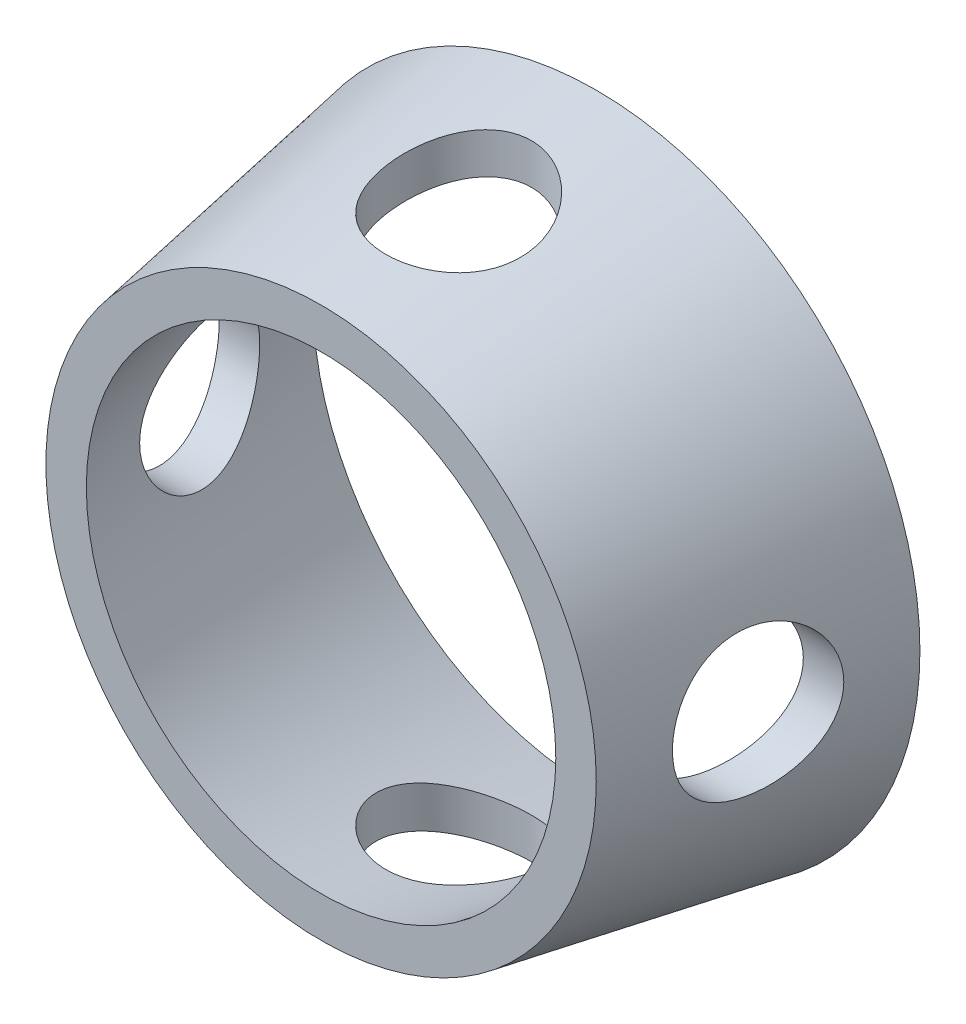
ISO-10303-21;
HEADER;
FILE_DESCRIPTION(('STEP AP214'),'2;1');
FILE_NAME('part.step','',(''),(''),'','','');
FILE_SCHEMA(('AUTOMOTIVE_DESIGN { 1 0 10303 214 1 1 1 1 }'));
ENDSEC;
DATA;
#1=APPLICATION_CONTEXT('core data for automotive mechanical design processes');
#2=APPLICATION_PROTOCOL_DEFINITION('international standard','automotive_design',2000,#1);
#3=PRODUCT_CONTEXT('',#1,'mechanical');
#4=PRODUCT('Part','Part','',(#3));
#5=PRODUCT_RELATED_PRODUCT_CATEGORY('part','',(#4));
#6=PRODUCT_DEFINITION_FORMATION('','',#4);
#7=PRODUCT_DEFINITION_CONTEXT('part definition',#1,'design');
#8=PRODUCT_DEFINITION('design','',#6,#7);
#9=PRODUCT_DEFINITION_SHAPE('','',#8);
#10=(LENGTH_UNIT() NAMED_UNIT(*) SI_UNIT(.MILLI.,.METRE.));
#11=(NAMED_UNIT(*) PLANE_ANGLE_UNIT() SI_UNIT($,.RADIAN.));
#12=(NAMED_UNIT(*) SI_UNIT($,.STERADIAN.) SOLID_ANGLE_UNIT());
#13=UNCERTAINTY_MEASURE_WITH_UNIT(LENGTH_MEASURE(1.E-05),#10,'distance_accuracy_value','');
#14=(GEOMETRIC_REPRESENTATION_CONTEXT(3) GLOBAL_UNCERTAINTY_ASSIGNED_CONTEXT((#13)) GLOBAL_UNIT_ASSIGNED_CONTEXT((#10,
#11,#12)) REPRESENTATION_CONTEXT('',''));
#15=CARTESIAN_POINT('',(0.,0.,0.));
#16=DIRECTION('',(0.,0.,1.));
#17=DIRECTION('',(1.,0.,0.));
#18=AXIS2_PLACEMENT_3D('',#15,#16,#17);
#19=CARTESIAN_POINT('',(0.,0.,0.));
#20=DIRECTION('',(0.,0.,-1.));
#21=DIRECTION('',(1.,0.,0.));
#22=AXIS2_PLACEMENT_3D('',#19,#20,#21);
#23=CONICAL_SURFACE('',#22,20.,0.174532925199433);
#24=CARTESIAN_POINT('',(0.,0.,17.));
#25=DIRECTION('',(0.,0.,1.));
#26=DIRECTION('',(1.,0.,0.));
#27=AXIS2_PLACEMENT_3D('',#24,#25,#26);
#28=CIRCLE('',#27,17.0024413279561);
#29=CARTESIAN_POINT('',(17.0024413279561,0.,17.));
#30=VERTEX_POINT('',#29);
#31=EDGE_CURVE('E10',#30,#30,#28,.T.);
#32=ORIENTED_EDGE('',*,*,#31,.F.);
#33=EDGE_LOOP('',(#32));
#34=FACE_BOUND('',#33,.T.);
#35=CARTESIAN_POINT('',(0.,0.,0.));
#36=DIRECTION('',(0.,0.,1.));
#37=DIRECTION('',(1.,0.,0.));
#38=AXIS2_PLACEMENT_3D('',#35,#36,#37);
#39=CIRCLE('',#38,20.);
#40=CARTESIAN_POINT('',(20.,0.,0.));
#41=VERTEX_POINT('',#40);
#42=EDGE_CURVE('E57',#41,#41,#39,.T.);
#43=ORIENTED_EDGE('',*,*,#42,.T.);
#44=EDGE_LOOP('',(#43));
#45=FACE_BOUND('',#44,.T.);
#46=CARTESIAN_POINT('',(-2.53523438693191,18.9882829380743,4.78212606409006));
#47=CARTESIAN_POINT('',(-2.75059170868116,18.9333994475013,4.92899463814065));
#48=CARTESIAN_POINT('',(-2.95239412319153,18.873221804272,5.0940789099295));
#49=CARTESIAN_POINT('',(-3.32383809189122,18.7466685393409,5.45542423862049));
#50=CARTESIAN_POINT('',(-3.49343369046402,18.6802842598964,5.6517291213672));
#51=CARTESIAN_POINT('',(-3.79611055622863,18.5459016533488,6.06977252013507));
#52=CARTESIAN_POINT('',(-3.92924484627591,18.4779058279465,6.29147343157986));
#53=CARTESIAN_POINT('',(-4.15586947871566,18.3444825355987,6.75492993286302));
#54=CARTESIAN_POINT('',(-4.2493715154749,18.2790543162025,6.99667958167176));
#55=CARTESIAN_POINT('',(-4.39457668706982,18.1539613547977,7.49689535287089));
#56=CARTESIAN_POINT('',(-4.44582021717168,18.094366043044,7.75551309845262));
#57=CARTESIAN_POINT('',(-4.5023293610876,17.9851081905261,8.27980086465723));
#58=CARTESIAN_POINT('',(-4.50760583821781,17.9354433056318,8.54546920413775));
#59=CARTESIAN_POINT('',(-4.47167713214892,17.8500224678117,9.06493249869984));
#60=CARTESIAN_POINT('',(-4.43232558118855,17.8137890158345,9.3187767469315));
#61=CARTESIAN_POINT('',(-4.31049599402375,17.7532050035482,9.81735782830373));
#62=CARTESIAN_POINT('',(-4.22802816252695,17.7288516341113,10.0620968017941));
#63=CARTESIAN_POINT('',(-4.02611200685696,17.6920192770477,10.525279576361));
#64=CARTESIAN_POINT('',(-3.90823735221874,17.6791128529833,10.7443776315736));
#65=CARTESIAN_POINT('',(-3.63783431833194,17.6618372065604,11.1603957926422));
#66=CARTESIAN_POINT('',(-3.48530564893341,17.6574680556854,11.3573157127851));
#67=CARTESIAN_POINT('',(-3.14993142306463,17.6548218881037,11.7232787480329));
#68=CARTESIAN_POINT('',(-2.96709538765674,17.6565429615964,11.8923305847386));
#69=CARTESIAN_POINT('',(-2.57611995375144,17.6633432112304,12.1979982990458));
#70=CARTESIAN_POINT('',(-2.36797860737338,17.6684226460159,12.3346116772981));
#71=CARTESIAN_POINT('',(-1.92860097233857,17.679421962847,12.5735751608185));
#72=CARTESIAN_POINT('',(-1.69705163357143,17.6853538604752,12.6753495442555));
#73=CARTESIAN_POINT('',(-1.22016322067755,17.6957621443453,12.8387480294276));
#74=CARTESIAN_POINT('',(-0.974824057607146,17.7002385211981,12.9003718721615));
#75=CARTESIAN_POINT('',(-0.476364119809,17.706298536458,12.9818605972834));
#76=CARTESIAN_POINT('',(-0.223218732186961,17.7078718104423,13.0015758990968));
#77=CARTESIAN_POINT('',(0.282784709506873,17.7076113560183,12.9982269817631));
#78=CARTESIAN_POINT('',(0.535642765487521,17.7057776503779,12.9751630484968));
#79=CARTESIAN_POINT('',(1.03318976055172,17.6992757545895,12.8870468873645));
#80=CARTESIAN_POINT('',(1.27789877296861,17.6946151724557,12.822107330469));
#81=CARTESIAN_POINT('',(1.75297753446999,17.6839882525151,12.65219434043));
#82=CARTESIAN_POINT('',(1.98334661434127,17.6780218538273,12.547219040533));
#83=CARTESIAN_POINT('',(2.42388463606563,17.6670591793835,12.2998385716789));
#84=CARTESIAN_POINT('',(2.63399694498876,17.6620655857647,12.1573323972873));
#85=CARTESIAN_POINT('',(3.02735610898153,17.6558576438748,11.8390296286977));
#86=CARTESIAN_POINT('',(3.21060359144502,17.6546432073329,11.6632338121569));
#87=CARTESIAN_POINT('',(3.54439860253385,17.6588686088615,11.2840299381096));
#88=CARTESIAN_POINT('',(3.69505311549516,17.6642862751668,11.0807158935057));
#89=CARTESIAN_POINT('',(3.96005210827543,17.6842344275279,10.6520807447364));
#90=CARTESIAN_POINT('',(4.07440230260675,17.698763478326,10.426763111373));
#91=CARTESIAN_POINT('',(4.26212904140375,17.7382887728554,9.96473521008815));
#92=CARTESIAN_POINT('',(4.3361283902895,17.7631148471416,9.72826316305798));
#93=CARTESIAN_POINT('',(4.44426786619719,17.823702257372,9.2477534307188));
#94=CARTESIAN_POINT('',(4.47840857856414,17.8594634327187,9.00371585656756));
#95=CARTESIAN_POINT('',(4.5066249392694,17.9412085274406,8.51510268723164));
#96=CARTESIAN_POINT('',(4.50070350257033,17.9871917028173,8.27052713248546));
#97=CARTESIAN_POINT('',(4.44984008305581,18.0876063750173,7.78725763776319));
#98=CARTESIAN_POINT('',(4.40489048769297,18.1420395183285,7.54856485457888));
#99=CARTESIAN_POINT('',(4.2754507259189,18.258923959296,7.07409282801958));
#100=CARTESIAN_POINT('',(4.18954915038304,18.3215985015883,6.83875382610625));
#101=CARTESIAN_POINT('',(3.98043067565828,18.4498139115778,6.38613959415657));
#102=CARTESIAN_POINT('',(3.85720275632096,18.515355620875,6.16886972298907));
#103=CARTESIAN_POINT('',(3.57025198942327,18.6483388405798,5.74851081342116));
#104=CARTESIAN_POINT('',(3.40501959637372,18.7157413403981,5.54642901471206));
#105=CARTESIAN_POINT('',(3.13228162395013,18.8126432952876,5.26644664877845));
#106=CARTESIAN_POINT('',(3.03715656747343,18.8442612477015,5.17692944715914));
#107=CARTESIAN_POINT('',(2.83913337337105,18.9055455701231,5.00623722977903));
#108=CARTESIAN_POINT('',(2.73623860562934,18.9352127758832,4.92505863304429));
#109=CARTESIAN_POINT('',(2.52403621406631,18.9918445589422,4.77223573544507));
#110=CARTESIAN_POINT('',(2.41477779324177,19.0188263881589,4.70052945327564));
#111=CARTESIAN_POINT('',(2.18995850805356,19.0697826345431,4.56665711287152));
#112=CARTESIAN_POINT('',(2.07440051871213,19.0937584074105,4.50448675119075));
#113=CARTESIAN_POINT('',(1.83773786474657,19.1382220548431,4.39025734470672));
#114=CARTESIAN_POINT('',(1.71663303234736,19.1587098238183,4.33819860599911));
#115=CARTESIAN_POINT('',(1.46984520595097,19.1957423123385,4.24477362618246));
#116=CARTESIAN_POINT('',(1.34416453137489,19.2122889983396,4.20340205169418));
#117=CARTESIAN_POINT('',(1.0972152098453,19.24016935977,4.13405016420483));
#118=CARTESIAN_POINT('',(0.976166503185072,19.2517655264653,4.10539107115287));
#119=CARTESIAN_POINT('',(0.731853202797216,19.270932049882,4.05816910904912));
#120=CARTESIAN_POINT('',(0.608589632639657,19.2785042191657,4.03960169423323));
#121=CARTESIAN_POINT('',(0.36075692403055,19.289468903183,4.01275240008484));
#122=CARTESIAN_POINT('',(0.236187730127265,19.2928612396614,4.00447095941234));
#123=CARTESIAN_POINT('',(-0.0132484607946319,19.2953919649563,3.99829068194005));
#124=CARTESIAN_POINT('',(-0.138115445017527,19.2945305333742,4.00039140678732));
#125=CARTESIAN_POINT('',(-0.380320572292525,19.2887366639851,4.01455041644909));
#126=CARTESIAN_POINT('',(-0.497696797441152,19.2840295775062,4.02605751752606));
#127=CARTESIAN_POINT('',(-0.731025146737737,19.270921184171,4.05821242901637));
#128=CARTESIAN_POINT('',(-0.84697672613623,19.262518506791,4.07886363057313));
#129=CARTESIAN_POINT('',(-1.07649219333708,19.2421870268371,4.12907930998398));
#130=CARTESIAN_POINT('',(-1.19005842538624,19.2302618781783,4.15863455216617));
#131=CARTESIAN_POINT('',(-1.41418582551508,19.2031024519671,4.22638362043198));
#132=CARTESIAN_POINT('',(-1.52474634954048,19.1878674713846,4.2645792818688));
#133=CARTESIAN_POINT('',(-1.79299494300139,19.146514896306,4.36908688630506));
#134=CARTESIAN_POINT('',(-1.94857392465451,19.1186380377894,4.4401983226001));
#135=CARTESIAN_POINT('',(-2.2497532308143,19.0573464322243,4.59901973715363));
#136=CARTESIAN_POINT('',(-2.39535315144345,19.0239314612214,4.686730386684));
#137=CARTESIAN_POINT('',(-2.53523438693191,18.9882829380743,4.78212606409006));
#138=B_SPLINE_CURVE_WITH_KNOTS('',3,(#46,#47,#48,#49,#50,#51,#52,#53,#54,#55,#56,#57,#58,#59,
#60,#61,#62,#63,#64,#65,#66,#67,#68,#69,#70,#71,#72,#73,#74,#75,#76,#77,#78,#79,#80,#81,#82,#83,
#84,#85,#86,#87,#88,#89,#90,#91,#92,#93,#94,#95,#96,#97,#98,#99,#100,#101,#102,#103,#104,#105,
#106,#107,#108,#109,#110,#111,#112,#113,#114,#115,#116,#117,#118,#119,#120,#121,#122,#123,#124,
#125,#126,#127,#128,#129,#130,#131,#132,#133,#134,#135,#136,#137),.UNSPECIFIED.,.T.,.F.,(4,2,2,
2,2,2,2,2,2,2,2,2,2,2,2,2,2,2,2,2,2,2,2,2,2,2,2,2,2,2,2,2,2,2,2,2,2,2,2,2,2,2,2,2,2,4),(0.,
0.798530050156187,1.59819109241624,2.39668299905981,3.19493912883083,4.00176669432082,
4.80840357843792,5.58272580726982,6.35686485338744,7.10070557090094,7.8445525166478,
8.58816622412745,9.33183720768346,10.0872631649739,10.8426939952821,11.6008166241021,
12.3589341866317,13.1150204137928,13.8711418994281,14.6293194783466,15.3874793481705,
16.1431115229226,16.8986246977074,17.6421205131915,18.3856054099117,19.1290362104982,
19.8726120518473,20.6439044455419,21.4154247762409,22.2200202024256,22.6227986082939,
23.0254033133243,23.42522719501,23.8248701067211,24.2245251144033,24.6239802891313,
24.9983022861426,25.3724555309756,25.7466247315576,26.1207781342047,26.4744572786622,
26.8282676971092,27.1817123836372,27.5352322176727,28.0538811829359,28.5725511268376),.UNSPECIFIED.);
#139=CARTESIAN_POINT('',(-2.53523438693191,18.9882829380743,4.78212606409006));
#140=VERTEX_POINT('',#139);
#141=EDGE_CURVE('E96',#140,#140,#138,.T.);
#142=ORIENTED_EDGE('',*,*,#141,.F.);
#143=EDGE_LOOP('',(#142));
#144=FACE_BOUND('',#143,.T.);
#145=CARTESIAN_POINT('',(-2.53523438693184,-18.9882829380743,4.78212606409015));
#146=CARTESIAN_POINT('',(-2.33800096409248,-19.0385404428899,4.64763371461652));
#147=CARTESIAN_POINT('',(-2.12925577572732,-19.0843920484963,4.52832149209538));
#148=CARTESIAN_POINT('',(-1.69348887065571,-19.1641689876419,4.32387982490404));
#149=CARTESIAN_POINT('',(-1.46646971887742,-19.1980959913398,4.23874559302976));
#150=CARTESIAN_POINT('',(-0.99951937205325,-19.251558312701,4.10568406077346));
#151=CARTESIAN_POINT('',(-0.759559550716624,-19.2710601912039,4.05784319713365));
#152=CARTESIAN_POINT('',(-0.274305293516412,-19.2939629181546,4.00173603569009));
#153=CARTESIAN_POINT('',(-0.0290118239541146,-19.297366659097,3.99346262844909));
#154=CARTESIAN_POINT('',(0.45076012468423,-19.2879708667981,4.01642060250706));
#155=CARTESIAN_POINT('',(0.685316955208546,-19.2757334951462,4.04628136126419));
#156=CARTESIAN_POINT('',(1.14572367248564,-19.2369578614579,4.14194865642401));
#157=CARTESIAN_POINT('',(1.37157321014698,-19.2104190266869,4.2077566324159));
#158=CARTESIAN_POINT('',(1.8102407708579,-19.1447325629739,4.37345112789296));
#159=CARTESIAN_POINT('',(2.02295567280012,-19.105497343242,4.47357467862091));
#160=CARTESIAN_POINT('',(2.42873619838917,-19.0171209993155,4.70450487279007));
#161=CARTESIAN_POINT('',(2.62179689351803,-18.9679773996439,4.83531918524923));
#162=CARTESIAN_POINT('',(2.99527269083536,-18.8596241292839,5.13270220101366));
#163=CARTESIAN_POINT('',(3.17422651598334,-18.7999865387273,5.30094943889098));
#164=CARTESIAN_POINT('',(3.5019314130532,-18.6766938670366,5.66341344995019));
#165=CARTESIAN_POINT('',(3.65067170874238,-18.613037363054,5.85763944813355));
#166=CARTESIAN_POINT('',(3.92260377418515,-18.4816369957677,6.27967576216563));
#167=CARTESIAN_POINT('',(4.04376455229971,-18.413874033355,6.50879289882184));
#168=CARTESIAN_POINT('',(4.24533304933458,-18.2821948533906,6.98537468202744));
#169=CARTESIAN_POINT('',(4.3257376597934,-18.2182789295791,7.2328407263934));
#170=CARTESIAN_POINT('',(4.44321845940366,-18.0977432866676,7.74097815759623));
#171=CARTESIAN_POINT('',(4.48008061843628,-18.0411608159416,8.00170825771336));
#172=CARTESIAN_POINT('',(4.50760628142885,-17.9386973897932,8.52767063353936));
#173=CARTESIAN_POINT('',(4.49828520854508,-17.8928128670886,8.79290137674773));
#174=CARTESIAN_POINT('',(4.43417056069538,-17.8152740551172,9.30772171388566));
#175=CARTESIAN_POINT('',(4.38141118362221,-17.7830790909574,9.5574834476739));
#176=CARTESIAN_POINT('',(4.23393009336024,-17.7302960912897,10.0455714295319));
#177=CARTESIAN_POINT('',(4.13921616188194,-17.7097059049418,10.2838997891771));
#178=CARTESIAN_POINT('',(3.91426459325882,-17.679521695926,10.7337513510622));
#179=CARTESIAN_POINT('',(3.78533844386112,-17.6695789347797,10.9459089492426));
#180=CARTESIAN_POINT('',(3.49425988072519,-17.6574729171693,11.3462974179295));
#181=CARTESIAN_POINT('',(3.33210640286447,-17.6553099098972,11.5345275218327));
#182=CARTESIAN_POINT('',(2.97824702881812,-17.6562043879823,11.8825934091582));
#183=CARTESIAN_POINT('',(2.78640362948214,-17.6592868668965,12.0422892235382));
#184=CARTESIAN_POINT('',(2.37902626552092,-17.6679688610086,12.3278080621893));
#185=CARTESIAN_POINT('',(2.16349062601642,-17.673568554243,12.4536286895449));
#186=CARTESIAN_POINT('',(1.71123651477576,-17.6848612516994,12.6695790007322));
#187=CARTESIAN_POINT('',(1.47424935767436,-17.6905543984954,12.7591465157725));
#188=CARTESIAN_POINT('',(0.988583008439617,-17.699926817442,12.8973225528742));
#189=CARTESIAN_POINT('',(0.739903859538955,-17.7036060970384,12.9459312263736));
#190=CARTESIAN_POINT('',(0.237519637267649,-17.7077919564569,13.0008359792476));
#191=CARTESIAN_POINT('',(-0.0161922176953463,-17.7082939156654,13.0070704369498));
#192=CARTESIAN_POINT('',(-0.521047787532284,-17.70595970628,12.9768804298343));
#193=CARTESIAN_POINT('',(-0.772191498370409,-17.7031235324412,12.9404558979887));
#194=CARTESIAN_POINT('',(-1.2642491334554,-17.6950039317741,12.8261232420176));
#195=CARTESIAN_POINT('',(-1.50518335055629,-17.6897256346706,12.7483020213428));
#196=CARTESIAN_POINT('',(-1.970622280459,-17.6785145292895,12.5534312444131));
#197=CARTESIAN_POINT('',(-2.19512620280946,-17.6725816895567,12.4363798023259));
#198=CARTESIAN_POINT('',(-2.62204636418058,-17.6625237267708,12.1659125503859));
#199=CARTESIAN_POINT('',(-2.82439435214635,-17.6584040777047,12.0123887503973));
#200=CARTESIAN_POINT('',(-3.20045612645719,-17.6548659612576,11.6735051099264));
#201=CARTESIAN_POINT('',(-3.37417133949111,-17.6554472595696,11.4881468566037));
#202=CARTESIAN_POINT('',(-3.68703941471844,-17.6641080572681,11.0921134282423));
#203=CARTESIAN_POINT('',(-3.82638433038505,-17.6721446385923,10.8815891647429));
#204=CARTESIAN_POINT('',(-4.06777539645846,-17.6979256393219,10.4407067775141));
#205=CARTESIAN_POINT('',(-4.16982730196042,-17.715668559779,10.2103517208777));
#206=CARTESIAN_POINT('',(-4.33261541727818,-17.7618163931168,9.74066224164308));
#207=CARTESIAN_POINT('',(-4.39398481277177,-17.7900466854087,9.50152971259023));
#208=CARTESIAN_POINT('',(-4.4768187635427,-17.8573011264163,9.01795832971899));
#209=CARTESIAN_POINT('',(-4.49828282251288,-17.8963254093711,8.77351940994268));
#210=CARTESIAN_POINT('',(-4.50152809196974,-17.9843473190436,8.28483713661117));
#211=CARTESIAN_POINT('',(-4.48309035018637,-18.0333986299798,8.04060225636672));
#212=CARTESIAN_POINT('',(-4.40743965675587,-18.1392652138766,7.55994205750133));
#213=CARTESIAN_POINT('',(-4.35021592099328,-18.1960826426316,7.32351893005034));
#214=CARTESIAN_POINT('',(-4.19590981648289,-18.3171589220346,6.85445392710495));
#215=CARTESIAN_POINT('',(-4.09726393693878,-18.3816293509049,6.62238145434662));
#216=CARTESIAN_POINT('',(-3.86297811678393,-18.5122869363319,6.17826782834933));
#217=CARTESIAN_POINT('',(-3.72733727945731,-18.578474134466,5.9662271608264));
#218=CARTESIAN_POINT('',(-3.42987577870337,-18.7053589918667,5.57717534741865));
#219=CARTESIAN_POINT('',(-3.26969192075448,-18.7661659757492,5.39894677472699));
#220=CARTESIAN_POINT('',(-2.92199551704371,-18.8822409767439,5.06936074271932));
#221=CARTESIAN_POINT('',(-2.73448943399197,-18.9375102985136,4.91799694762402));
#222=CARTESIAN_POINT('',(-2.53523438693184,-18.9882829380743,4.78212606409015));
#223=B_SPLINE_CURVE_WITH_KNOTS('',3,(#145,#146,#147,#148,#149,#150,#151,#152,#153,#154,#155,
#156,#157,#158,#159,#160,#161,#162,#163,#164,#165,#166,#167,#168,#169,#170,#171,#172,#173,#174,
#175,#176,#177,#178,#179,#180,#181,#182,#183,#184,#185,#186,#187,#188,#189,#190,#191,#192,#193,
#194,#195,#196,#197,#198,#199,#200,#201,#202,#203,#204,#205,#206,#207,#208,#209,#210,#211,#212,
#213,#214,#215,#216,#217,#218,#219,#220,#221,#222),.UNSPECIFIED.,.T.,.F.,(4,2,2,2,2,2,2,2,2,2,2,
2,2,2,2,2,2,2,2,2,2,2,2,2,2,2,2,2,2,2,2,2,2,2,2,2,2,2,4),(0.,0.731080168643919,1.46205790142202,
2.19472486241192,2.92726017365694,3.63419269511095,4.34115352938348,5.05309946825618,
5.7652234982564,6.52022439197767,7.27549410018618,8.07542742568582,8.87542175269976,
9.67933224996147,10.4829742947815,11.2509894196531,12.0188621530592,12.7607335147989,
13.5026286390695,14.2480686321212,14.9935613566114,15.75020803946,16.5068519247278,
17.2645959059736,18.0223410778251,18.7785017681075,19.534698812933,20.2931633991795,
21.0515901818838,21.8056778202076,22.5596490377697,23.3015911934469,24.0435425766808,
24.7895755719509,25.5358160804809,26.3131942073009,27.0905911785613,27.8293393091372,
28.5679129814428),.UNSPECIFIED.);
#224=CARTESIAN_POINT('',(-2.53523438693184,-18.9882829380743,4.78212606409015));
#225=VERTEX_POINT('',#224);
#226=EDGE_CURVE('E103',#225,#225,#223,.T.);
#227=ORIENTED_EDGE('',*,*,#226,.F.);
#228=EDGE_LOOP('',(#227));
#229=FACE_BOUND('',#228,.T.);
#230=CARTESIAN_POINT('',(18.7921979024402,-3.18954443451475,5.3256002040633));
#231=CARTESIAN_POINT('',(18.8528047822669,-3.01609233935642,5.15132485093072));
#232=CARTESIAN_POINT('',(18.9108398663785,-2.82785524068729,4.99079320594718));
#233=CARTESIAN_POINT('',(19.0179710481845,-2.42584463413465,4.70176964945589));
#234=CARTESIAN_POINT('',(19.0670661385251,-2.21206825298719,4.57328134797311));
#235=CARTESIAN_POINT('',(19.1528921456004,-1.7634819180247,4.35237650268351));
#236=CARTESIAN_POINT('',(19.1895884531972,-1.52861536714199,4.26006081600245));
#237=CARTESIAN_POINT('',(19.2474655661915,-1.044993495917,4.11575589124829));
#238=CARTESIAN_POINT('',(19.268652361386,-0.796243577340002,4.06375108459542));
#239=CARTESIAN_POINT('',(19.2930932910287,-0.304915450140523,4.00385852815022));
#240=CARTESIAN_POINT('',(19.2971672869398,-0.0626229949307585,3.9939535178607));
#241=CARTESIAN_POINT('',(19.2893083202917,0.420123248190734,4.01314964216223));
#242=CARTESIAN_POINT('',(19.2773776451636,0.660577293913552,4.04224520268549));
#243=CARTESIAN_POINT('',(19.239030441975,1.12578967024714,4.1368173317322));
#244=CARTESIAN_POINT('',(19.2130348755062,1.35079981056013,4.20123736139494));
#245=CARTESIAN_POINT('',(19.1487210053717,1.78660175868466,4.36331888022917));
#246=CARTESIAN_POINT('',(19.1104009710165,1.99739156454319,4.46098503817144));
#247=CARTESIAN_POINT('',(19.0223488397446,2.40750503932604,4.69064181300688));
#248=CARTESIAN_POINT('',(18.9722431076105,2.60610367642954,4.82378089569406));
#249=CARTESIAN_POINT('',(18.8647215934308,2.97863800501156,5.11855232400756));
#250=CARTESIAN_POINT('',(18.8073034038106,3.1525655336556,5.2801940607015));
#251=CARTESIAN_POINT('',(18.6845119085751,3.48317548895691,5.63974060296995));
#252=CARTESIAN_POINT('',(18.6188632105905,3.63789432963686,5.83935919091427));
#253=CARTESIAN_POINT('',(18.48715720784,3.91186070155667,6.26153895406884));
#254=CARTESIAN_POINT('',(18.421099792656,4.03109817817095,6.48410660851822));
#255=CARTESIAN_POINT('',(18.2900651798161,4.23474287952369,6.95556231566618));
#256=CARTESIAN_POINT('',(18.2252197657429,4.31768805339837,7.20512179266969));
#257=CARTESIAN_POINT('',(18.1031832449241,4.43907937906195,7.71665200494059));
#258=CARTESIAN_POINT('',(18.0459908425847,4.47753307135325,7.97862062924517));
#259=CARTESIAN_POINT('',(17.9436086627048,4.50740853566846,8.50093080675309));
#260=CARTESIAN_POINT('',(17.8981601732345,4.49995449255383,8.761156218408));
#261=CARTESIAN_POINT('',(17.8192342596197,4.4398335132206,9.27816589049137));
#262=CARTESIAN_POINT('',(17.7857530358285,4.38718094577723,9.53495121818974));
#263=CARTESIAN_POINT('',(17.7323232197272,4.2411151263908,10.0248641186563));
#264=CARTESIAN_POINT('',(17.7118141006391,4.14972713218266,10.2585364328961));
#265=CARTESIAN_POINT('',(17.6808949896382,3.92906423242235,10.7079645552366));
#266=CARTESIAN_POINT('',(17.6704844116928,3.79979152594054,10.9237214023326));
#267=CARTESIAN_POINT('',(17.6578174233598,3.50912532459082,11.3279208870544));
#268=CARTESIAN_POINT('',(17.6554464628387,3.3482179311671,11.5167101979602));
#269=CARTESIAN_POINT('',(17.6559943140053,2.99761532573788,11.8653271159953));
#270=CARTESIAN_POINT('',(17.6589135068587,2.80791804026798,12.0251526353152));
#271=CARTESIAN_POINT('',(17.6674023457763,2.40197601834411,12.3135813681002));
#272=CARTESIAN_POINT('',(17.6730099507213,2.18538507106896,12.4416962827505));
#273=CARTESIAN_POINT('',(17.6843057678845,1.73390475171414,12.6601039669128));
#274=CARTESIAN_POINT('',(17.6899939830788,1.49901470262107,12.7503953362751));
#275=CARTESIAN_POINT('',(17.6994861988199,1.01526086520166,12.891272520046));
#276=CARTESIAN_POINT('',(17.703272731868,0.766290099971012,12.9414926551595));
#277=CARTESIAN_POINT('',(17.7076783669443,0.263425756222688,12.9994069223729));
#278=CARTESIAN_POINT('',(17.7082975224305,0.00953226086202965,13.0071017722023));
#279=CARTESIAN_POINT('',(17.7061828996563,-0.495281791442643,12.9797802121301));
#280=CARTESIAN_POINT('',(17.7034576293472,-0.746208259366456,12.9448721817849));
#281=CARTESIAN_POINT('',(17.6955119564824,-1.2386353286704,12.8335329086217));
#282=CARTESIAN_POINT('',(17.6902914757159,-1.48013563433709,12.7571003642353));
#283=CARTESIAN_POINT('',(17.6791147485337,-1.94712088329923,12.5647932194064));
#284=CARTESIAN_POINT('',(17.6731578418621,-2.17259116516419,12.4488830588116));
#285=CARTESIAN_POINT('',(17.662980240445,-2.60095102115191,12.1808806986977));
#286=CARTESIAN_POINT('',(17.6587595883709,-2.803840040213,12.0287876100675));
#287=CARTESIAN_POINT('',(17.6548991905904,-3.18146336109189,11.6925324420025));
#288=CARTESIAN_POINT('',(17.6552639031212,-3.3561700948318,11.5083393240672));
#289=CARTESIAN_POINT('',(17.6634126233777,-3.67211098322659,11.1133388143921));
#290=CARTESIAN_POINT('',(17.6711956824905,-3.81334941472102,10.9025348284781));
#291=CARTESIAN_POINT('',(17.6963435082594,-4.05668888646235,10.4635283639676));
#292=CARTESIAN_POINT('',(17.7135829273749,-4.15927292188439,10.2355864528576));
#293=CARTESIAN_POINT('',(17.7588917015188,-4.32513930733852,9.76687072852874));
#294=CARTESIAN_POINT('',(17.7869598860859,-4.38842590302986,9.52609830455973));
#295=CARTESIAN_POINT('',(17.853739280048,-4.47401521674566,9.04142947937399));
#296=CARTESIAN_POINT('',(17.892339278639,-4.49672843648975,8.79758980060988));
#297=CARTESIAN_POINT('',(17.979286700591,-4.50261429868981,8.31117760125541));
#298=CARTESIAN_POINT('',(18.0276360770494,-4.4857790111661,8.06860534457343));
#299=CARTESIAN_POINT('',(18.1333626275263,-4.41295396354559,7.58507089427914));
#300=CARTESIAN_POINT('',(18.1909329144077,-4.35600953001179,7.3442956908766));
#301=CARTESIAN_POINT('',(18.3112767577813,-4.20412293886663,6.87647202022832));
#302=CARTESIAN_POINT('',(18.3740501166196,-4.10918222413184,6.64942303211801));
#303=CARTESIAN_POINT('',(18.4972285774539,-3.89132339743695,6.22842178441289));
#304=CARTESIAN_POINT('',(18.5575206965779,-3.77063675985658,6.03327649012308));
#305=CARTESIAN_POINT('',(18.6766896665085,-3.50078453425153,5.66328760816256));
#306=CARTESIAN_POINT('',(18.735566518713,-3.35161897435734,5.48844400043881));
#307=CARTESIAN_POINT('',(18.7921979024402,-3.18954443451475,5.3256002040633));
#308=B_SPLINE_CURVE_WITH_KNOTS('',3,(#230,#231,#232,#233,#234,#235,#236,#237,#238,#239,#240,
#241,#242,#243,#244,#245,#246,#247,#248,#249,#250,#251,#252,#253,#254,#255,#256,#257,#258,#259,
#260,#261,#262,#263,#264,#265,#266,#267,#268,#269,#270,#271,#272,#273,#274,#275,#276,#277,#278,
#279,#280,#281,#282,#283,#284,#285,#286,#287,#288,#289,#290,#291,#292,#293,#294,#295,#296,#297,
#298,#299,#300,#301,#302,#303,#304,#305,#306,#307),.UNSPECIFIED.,.T.,.F.,(4,2,2,2,2,2,2,2,2,2,2,
2,2,2,2,2,2,2,2,2,2,2,2,2,2,2,2,2,2,2,2,2,2,2,2,2,2,2,4),(0.,0.758950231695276,1.51798592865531,
2.27912317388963,3.03996631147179,3.76391027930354,4.4877507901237,5.19103706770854,
5.89442214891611,6.62414878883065,7.35411631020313,8.13348352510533,8.91307138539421,
9.72168417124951,10.5301598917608,11.3189177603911,12.1074249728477,12.8589897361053,
13.6105108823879,14.351278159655,15.0920988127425,15.843702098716,16.5953332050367,
17.3537474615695,18.1121489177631,18.8686250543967,19.6251249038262,20.3823079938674,
21.1395096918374,21.8974476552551,22.6552887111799,23.4033188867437,24.1512682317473,
24.8916063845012,25.6320929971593,26.3908276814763,27.1495335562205,27.8587013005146,
28.5678683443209),.UNSPECIFIED.);
#309=CARTESIAN_POINT('',(18.7921979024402,-3.18954443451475,5.3256002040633));
#310=VERTEX_POINT('',#309);
#311=EDGE_CURVE('E140',#310,#310,#308,.T.);
#312=ORIENTED_EDGE('',*,*,#311,.F.);
#313=EDGE_LOOP('',(#312));
#314=FACE_BOUND('',#313,.T.);
#315=CARTESIAN_POINT('',(-18.7921979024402,-3.18954443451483,5.32560020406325));
#316=CARTESIAN_POINT('',(-18.7279202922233,-3.37348384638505,5.51043208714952));
#317=CARTESIAN_POINT('',(-18.6607006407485,-3.54094190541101,5.71086917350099));
#318=CARTESIAN_POINT('',(-18.5249187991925,-3.83877017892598,6.13744665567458));
#319=CARTESIAN_POINT('',(-18.4563552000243,-3.96909896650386,6.36361537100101));
#320=CARTESIAN_POINT('',(-18.3222625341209,-4.18909400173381,6.83587315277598));
#321=CARTESIAN_POINT('',(-18.2567339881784,-4.27875329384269,7.08196561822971));
#322=CARTESIAN_POINT('',(-18.1327026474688,-4.41428398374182,7.58756169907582));
#323=CARTESIAN_POINT('',(-18.0741968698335,-4.46017403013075,7.8470595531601));
#324=CARTESIAN_POINT('',(-17.9683262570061,-4.50550356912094,8.36767204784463));
#325=CARTESIAN_POINT('',(-17.9207867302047,-4.50573028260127,8.62868167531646));
#326=CARTESIAN_POINT('',(-17.8375715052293,-4.46063723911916,9.14865576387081));
#327=CARTESIAN_POINT('',(-17.8018926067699,-4.41532978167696,9.40762075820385));
#328=CARTESIAN_POINT('',(-17.7443429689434,-4.28303958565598,9.90290376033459));
#329=CARTESIAN_POINT('',(-17.7218965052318,-4.19814013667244,10.1397131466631));
#330=CARTESIAN_POINT('',(-17.6874245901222,-3.98970905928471,10.596478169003));
#331=CARTESIAN_POINT('',(-17.6753982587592,-3.86618069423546,10.8164352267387));
#332=CARTESIAN_POINT('',(-17.6599964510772,-3.58651400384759,11.2290935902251));
#333=CARTESIAN_POINT('',(-17.6564704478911,-3.43099685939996,11.4222111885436));
#334=CARTESIAN_POINT('',(-17.655156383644,-3.0903858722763,11.7803340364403));
#335=CARTESIAN_POINT('',(-17.6573687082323,-2.90529004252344,11.9453373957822));
#336=CARTESIAN_POINT('',(-17.6648830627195,-2.50791277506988,12.2447423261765));
#337=CARTESIAN_POINT('',(-17.670226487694,-2.29529742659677,12.3786996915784));
#338=CARTESIAN_POINT('',(-17.6813962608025,-1.85077134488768,12.6094236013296));
#339=CARTESIAN_POINT('',(-17.687222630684,-1.61885974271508,12.7061884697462));
#340=CARTESIAN_POINT('',(-17.6972930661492,-1.13968115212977,12.8606346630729));
#341=CARTESIAN_POINT('',(-17.7015202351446,-0.892280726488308,12.9179036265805));
#342=CARTESIAN_POINT('',(-17.7069425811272,-0.391346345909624,12.9900872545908));
#343=CARTESIAN_POINT('',(-17.7081378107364,-0.137812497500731,13.0050026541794));
#344=CARTESIAN_POINT('',(-17.7071325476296,0.367605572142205,12.9920632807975));
#345=CARTESIAN_POINT('',(-17.7049393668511,0.619492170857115,12.9643006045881));
#346=CARTESIAN_POINT('',(-17.6978448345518,1.11501928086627,12.8669773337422));
#347=CARTESIAN_POINT('',(-17.6929434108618,1.35865957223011,12.7974156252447));
#348=CARTESIAN_POINT('',(-17.6820535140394,1.83090316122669,12.6184437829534));
#349=CARTESIAN_POINT('',(-17.6760646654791,2.05950122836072,12.5090198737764));
#350=CARTESIAN_POINT('',(-17.6653691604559,2.49516261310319,12.2533919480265));
#351=CARTESIAN_POINT('',(-17.6606625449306,2.70222524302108,12.1071867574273));
#352=CARTESIAN_POINT('',(-17.6553335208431,3.08927867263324,11.7818249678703));
#353=CARTESIAN_POINT('',(-17.6547179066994,3.26922395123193,11.6026140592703));
#354=CARTESIAN_POINT('',(-17.6604562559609,3.59641232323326,11.2165816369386));
#355=CARTESIAN_POINT('',(-17.6668094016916,3.7436592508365,11.009763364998));
#356=CARTESIAN_POINT('',(-17.688800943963,3.99965725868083,10.5772899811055));
#357=CARTESIAN_POINT('',(-17.7043285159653,4.10884347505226,10.3518868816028));
#358=CARTESIAN_POINT('',(-17.7460984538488,4.28815561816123,9.88700277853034));
#359=CARTESIAN_POINT('',(-17.7723396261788,4.35828589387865,9.64752334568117));
#360=CARTESIAN_POINT('',(-17.8355244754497,4.45739304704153,9.1646060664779));
#361=CARTESIAN_POINT('',(-17.8723377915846,4.48684722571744,8.92124862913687));
#362=CARTESIAN_POINT('',(-17.9559536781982,4.50611103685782,8.43470318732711));
#363=CARTESIAN_POINT('',(-18.0027573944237,4.49591611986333,8.19151520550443));
#364=CARTESIAN_POINT('',(-18.1055778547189,4.43637163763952,7.70654909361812));
#365=CARTESIAN_POINT('',(-18.1617687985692,4.38619700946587,7.4649100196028));
#366=CARTESIAN_POINT('',(-18.2798601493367,4.24770540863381,6.99427730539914));
#367=CARTESIAN_POINT('',(-18.3417620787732,4.15937824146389,6.76528706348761));
#368=CARTESIAN_POINT('',(-18.4709577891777,3.94210239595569,6.31474502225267));
#369=CARTESIAN_POINT('',(-18.5383680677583,3.81142688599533,6.09406013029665));
#370=CARTESIAN_POINT('',(-18.6717283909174,3.514168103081,5.6775885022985));
#371=CARTESIAN_POINT('',(-18.7376780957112,3.34757656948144,5.48180751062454));
#372=CARTESIAN_POINT('',(-18.8328275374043,3.07202954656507,5.20912518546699));
#373=CARTESIAN_POINT('',(-18.8642205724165,2.97475392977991,5.12092660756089));
#374=CARTESIAN_POINT('',(-18.9249151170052,2.77248979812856,4.95309407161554));
#375=CARTESIAN_POINT('',(-18.9542174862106,2.66750448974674,4.87345658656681));
#376=CARTESIAN_POINT('',(-19.0101782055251,2.45044590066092,4.72339652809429));
#377=CARTESIAN_POINT('',(-19.036835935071,2.3383709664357,4.65297611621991));
#378=CARTESIAN_POINT('',(-19.0869505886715,2.10795376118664,4.52205126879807));
#379=CARTESIAN_POINT('',(-19.11040905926,1.98961455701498,4.46154203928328));
#380=CARTESIAN_POINT('',(-19.1527119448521,1.75266694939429,4.35338853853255));
#381=CARTESIAN_POINT('',(-19.171710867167,1.63428683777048,4.30530449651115));
#382=CARTESIAN_POINT('',(-19.2059308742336,1.39342709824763,4.21926345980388));
#383=CARTESIAN_POINT('',(-19.2211536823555,1.27094936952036,4.18130184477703));
#384=CARTESIAN_POINT('',(-19.2475012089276,1.02281273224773,4.11590231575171));
#385=CARTESIAN_POINT('',(-19.2586268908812,0.8971545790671,4.08846192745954));
#386=CARTESIAN_POINT('',(-19.2765361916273,0.643650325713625,4.0444122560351));
#387=CARTESIAN_POINT('',(-19.2833200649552,0.515804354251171,4.02780233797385));
#388=CARTESIAN_POINT('',(-19.2920813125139,0.267798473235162,4.00637120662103));
#389=CARTESIAN_POINT('',(-19.2943559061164,0.147711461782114,4.00082088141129));
#390=CARTESIAN_POINT('',(-19.2949590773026,-0.0925745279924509,3.99934801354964));
#391=CARTESIAN_POINT('',(-19.2932863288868,-0.212773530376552,4.00342870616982));
#392=CARTESIAN_POINT('',(-19.2860268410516,-0.452295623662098,4.02117809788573));
#393=CARTESIAN_POINT('',(-19.2804415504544,-0.571619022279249,4.0348432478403));
#394=CARTESIAN_POINT('',(-19.2654671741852,-0.808602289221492,4.07162038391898));
#395=CARTESIAN_POINT('',(-19.2560766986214,-0.926261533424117,4.09473582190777));
#396=CARTESIAN_POINT('',(-19.2339254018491,-1.15643734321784,4.14955904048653));
#397=CARTESIAN_POINT('',(-19.2212443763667,-1.26901008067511,4.18106379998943));
#398=CARTESIAN_POINT('',(-19.1926462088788,-1.49103556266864,4.25259812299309));
#399=CARTESIAN_POINT('',(-19.1767278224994,-1.60048708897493,4.29263096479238));
#400=CARTESIAN_POINT('',(-19.1419484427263,-1.81547139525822,4.38083148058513));
#401=CARTESIAN_POINT('',(-19.1230898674,-1.92100730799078,4.42899247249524));
#402=CARTESIAN_POINT('',(-19.0827352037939,-2.12766184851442,4.53308005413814));
#403=CARTESIAN_POINT('',(-19.0612384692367,-2.2287793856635,4.58900854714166));
#404=CARTESIAN_POINT('',(-19.0024011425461,-2.48502758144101,4.74387090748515));
#405=CARTESIAN_POINT('',(-18.9632674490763,-2.63633735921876,4.84853575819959));
#406=CARTESIAN_POINT('',(-18.8806348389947,-2.92429934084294,5.07478991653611));
#407=CARTESIAN_POINT('',(-18.8371353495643,-3.06094961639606,5.19638144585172));
#408=CARTESIAN_POINT('',(-18.7921979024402,-3.18954443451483,5.32560020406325));
#409=B_SPLINE_CURVE_WITH_KNOTS('',3,(#315,#316,#317,#318,#319,#320,#321,#322,#323,#324,#325,
#326,#327,#328,#329,#330,#331,#332,#333,#334,#335,#336,#337,#338,#339,#340,#341,#342,#343,#344,
#345,#346,#347,#348,#349,#350,#351,#352,#353,#354,#355,#356,#357,#358,#359,#360,#361,#362,#363,
#364,#365,#366,#367,#368,#369,#370,#371,#372,#373,#374,#375,#376,#377,#378,#379,#380,#381,#382,
#383,#384,#385,#386,#387,#388,#389,#390,#391,#392,#393,#394,#395,#396,#397,#398,#399,#400,#401,
#402,#403,#404,#405,#406,#407,#408),.UNSPECIFIED.,.T.,.F.,(4,2,2,2,2,2,2,2,2,2,2,2,2,2,2,2,2,2,
2,2,2,2,2,2,2,2,2,2,2,2,2,2,2,2,2,2,2,2,2,2,2,2,2,2,2,2,4),(0.,0.80504602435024,
1.61098679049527,2.4170653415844,3.22280029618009,4.01464343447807,4.8062727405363,
5.56027402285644,6.31421162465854,7.05469685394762,7.79523184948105,8.54578539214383,
9.29637275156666,10.0546826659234,10.8129794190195,11.5696421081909,12.326324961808,
13.0832695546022,13.8402383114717,14.5984639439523,15.3566006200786,16.1057612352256,
16.8548384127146,17.5950488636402,18.3353442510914,19.0913256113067,19.8475090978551,
20.6395315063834,21.4317362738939,21.8363395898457,22.2407755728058,22.6453062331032,
23.0496406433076,23.4366698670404,23.8235221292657,24.2102833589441,24.5970219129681,
24.9572882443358,25.3176756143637,25.6779296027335,26.0383152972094,26.3906675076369,
26.7431554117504,27.095354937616,27.4476409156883,28.0103868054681,28.5732066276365),.UNSPECIFIED.);
#410=CARTESIAN_POINT('',(-18.7921979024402,-3.18954443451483,5.32560020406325));
#411=VERTEX_POINT('',#410);
#412=EDGE_CURVE('E76',#411,#411,#409,.T.);
#413=ORIENTED_EDGE('',*,*,#412,.F.);
#414=EDGE_LOOP('',(#413));
#415=FACE_BOUND('',#414,.T.);
#416=ADVANCED_FACE('F43',(#34,#45,#144,#229,#314,#415),#23,.T.);
#417=CARTESIAN_POINT('',(0.,0.,0.));
#418=DIRECTION('',(0.,0.,-1.));
#419=DIRECTION('',(-1.,0.,0.));
#420=AXIS2_PLACEMENT_3D('',#417,#418,#419);
#421=CONICAL_SURFACE('',#420,17.5,0.174532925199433);
#422=CARTESIAN_POINT('',(0.,0.,17.));
#423=DIRECTION('',(0.,0.,-1.));
#424=DIRECTION('',(-1.,0.,0.));
#425=AXIS2_PLACEMENT_3D('',#422,#423,#424);
#426=CIRCLE('',#425,14.5024413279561);
#427=CARTESIAN_POINT('',(-14.5024413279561,0.,17.));
#428=VERTEX_POINT('',#427);
#429=EDGE_CURVE('E63',#428,#428,#426,.T.);
#430=ORIENTED_EDGE('',*,*,#429,.F.);
#431=EDGE_LOOP('',(#430));
#432=FACE_BOUND('',#431,.T.);
#433=CARTESIAN_POINT('',(0.,0.,0.));
#434=DIRECTION('',(0.,0.,-1.));
#435=DIRECTION('',(-1.,0.,0.));
#436=AXIS2_PLACEMENT_3D('',#433,#434,#435);
#437=CIRCLE('',#436,17.5);
#438=CARTESIAN_POINT('',(-17.5,0.,0.));
#439=VERTEX_POINT('',#438);
#440=EDGE_CURVE('E114',#439,#439,#437,.T.);
#441=ORIENTED_EDGE('',*,*,#440,.T.);
#442=EDGE_LOOP('',(#441));
#443=FACE_BOUND('',#442,.T.);
#444=CARTESIAN_POINT('',(-2.69741864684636,16.4162025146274,4.89806542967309));
#445=CARTESIAN_POINT('',(-2.50662535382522,16.4730837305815,4.75518362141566));
#446=CARTESIAN_POINT('',(-2.30366329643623,16.5257812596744,4.6268815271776));
#447=CARTESIAN_POINT('',(-1.87770798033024,16.6192263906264,4.40341745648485));
#448=CARTESIAN_POINT('',(-1.6547224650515,16.6599785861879,4.30824273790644));
#449=CARTESIAN_POINT('',(-1.19354904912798,16.7265627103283,4.15434841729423));
#450=CARTESIAN_POINT('',(-0.955317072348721,16.7523489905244,4.09574030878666));
#451=CARTESIAN_POINT('',(-0.471271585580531,16.7866456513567,4.01804312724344));
#452=CARTESIAN_POINT('',(-0.225459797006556,16.7951599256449,3.99894514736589));
#453=CARTESIAN_POINT('',(0.254724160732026,16.7942060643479,4.00109565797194));
#454=CARTESIAN_POINT('',(0.489108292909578,16.785537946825,4.02054916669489));
#455=CARTESIAN_POINT('',(0.950891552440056,16.7525017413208,4.09539767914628));
#456=CARTESIAN_POINT('',(1.17829069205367,16.7281336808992,4.15079261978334));
#457=CARTESIAN_POINT('',(1.61942293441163,16.6656374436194,4.2950973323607));
#458=CARTESIAN_POINT('',(1.83319122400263,16.6275465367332,4.38391635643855));
#459=CARTESIAN_POINT('',(2.24285179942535,16.5402395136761,4.59200280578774));
#460=CARTESIAN_POINT('',(2.4387396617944,16.4910206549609,4.71127773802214));
#461=CARTESIAN_POINT('',(2.82069383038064,16.3811090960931,4.98539603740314));
#462=CARTESIAN_POINT('',(3.00531643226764,16.3198817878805,5.1420346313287));
#463=CARTESIAN_POINT('',(3.34633807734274,16.1922348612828,5.48172156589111));
#464=CARTESIAN_POINT('',(3.50272536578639,16.125813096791,5.66478084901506));
#465=CARTESIAN_POINT('',(3.79458326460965,15.9867946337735,6.06743091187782));
#466=CARTESIAN_POINT('',(3.92767755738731,15.9141024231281,6.28871652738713));
#467=CARTESIAN_POINT('',(4.15448718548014,15.7720111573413,6.7516606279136));
#468=CARTESIAN_POINT('',(4.24819583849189,15.7026126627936,6.99332256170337));
#469=CARTESIAN_POINT('',(4.39415230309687,15.5705619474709,7.49473963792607));
#470=CARTESIAN_POINT('',(4.44578299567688,15.5080213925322,7.75470537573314));
#471=CARTESIAN_POINT('',(4.50253582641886,15.3947647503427,8.28217971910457));
#472=CARTESIAN_POINT('',(4.50767785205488,15.3440436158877,8.54968505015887));
#473=CARTESIAN_POINT('',(4.47098953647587,15.2592352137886,9.06977027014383));
#474=CARTESIAN_POINT('',(4.43158917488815,15.2244198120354,9.32240258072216));
#475=CARTESIAN_POINT('',(4.31001618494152,15.1683268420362,9.81870361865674));
#476=CARTESIAN_POINT('',(4.22785460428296,15.14704578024,10.0623746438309));
#477=CARTESIAN_POINT('',(4.02757851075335,15.1176321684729,10.5220300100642));
#478=CARTESIAN_POINT('',(3.91127117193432,15.1089451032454,10.7387697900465));
#479=CARTESIAN_POINT('',(3.64483163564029,15.1007410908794,11.1505359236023));
#480=CARTESIAN_POINT('',(3.49469776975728,15.1012245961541,11.3455612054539));
#481=CARTESIAN_POINT('',(3.16372219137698,15.1084421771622,11.7096387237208));
#482=CARTESIAN_POINT('',(2.98269192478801,15.1152158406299,11.8785185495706));
#483=CARTESIAN_POINT('',(2.59551116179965,15.1317869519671,12.1843173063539));
#484=CARTESIAN_POINT('',(2.38935790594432,15.1415847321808,12.3212327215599));
#485=CARTESIAN_POINT('',(1.95252494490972,15.1613217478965,12.5621728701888));
#486=CARTESIAN_POINT('',(1.72139680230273,15.1712591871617,12.6653857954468));
#487=CARTESIAN_POINT('',(1.24503162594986,15.1883381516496,12.8316903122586));
#488=CARTESIAN_POINT('',(0.999794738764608,15.1954797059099,12.8947823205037));
#489=CARTESIAN_POINT('',(0.501696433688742,15.2052025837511,12.9790851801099));
#490=CARTESIAN_POINT('',(0.248822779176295,15.2077761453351,13.0002247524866));
#491=CARTESIAN_POINT('',(-0.256879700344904,15.2077219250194,12.9997716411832));
#492=CARTESIAN_POINT('',(-0.509708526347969,15.2050942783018,12.9781800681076));
#493=CARTESIAN_POINT('',(-1.00659466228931,15.1952975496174,12.8931685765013));
#494=CARTESIAN_POINT('',(-1.25069484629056,15.1881552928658,12.829995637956));
#495=CARTESIAN_POINT('',(-1.72487417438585,15.1711138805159,12.6638838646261));
#496=CARTESIAN_POINT('',(-1.9549522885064,15.161214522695,12.5609421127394));
#497=CARTESIAN_POINT('',(-2.39596544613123,15.1412836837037,12.3174788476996));
#498=CARTESIAN_POINT('',(-2.60678649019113,15.1312517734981,12.1767508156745));
#499=CARTESIAN_POINT('',(-3.00194980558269,15.114448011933,11.8618624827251));
#500=CARTESIAN_POINT('',(-3.18629191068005,15.1076761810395,11.6877019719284));
#501=CARTESIAN_POINT('',(-3.52313250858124,15.1009207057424,11.3109332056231));
#502=CARTESIAN_POINT('',(-3.67564837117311,15.1009333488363,11.1083405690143));
#503=CARTESIAN_POINT('',(-3.94444029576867,15.1109225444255,10.6806310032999));
#504=CARTESIAN_POINT('',(-4.06072435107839,15.1208968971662,10.4555190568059));
#505=CARTESIAN_POINT('',(-4.25157441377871,15.15270332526,9.99494763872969));
#506=CARTESIAN_POINT('',(-4.32701257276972,15.1742661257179,9.75983067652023));
#507=CARTESIAN_POINT('',(-4.43834319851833,15.2298816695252,9.28186915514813));
#508=CARTESIAN_POINT('',(-4.47423789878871,15.2639337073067,9.03902503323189));
#509=CARTESIAN_POINT('',(-4.50616310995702,15.3435814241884,8.55460859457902));
#510=CARTESIAN_POINT('',(-4.50249965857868,15.3890858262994,8.31304095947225));
#511=CARTESIAN_POINT('',(-4.45714377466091,15.4898986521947,7.835613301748));
#512=CARTESIAN_POINT('',(-4.41544349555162,15.5452090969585,7.59975446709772));
#513=CARTESIAN_POINT('',(-4.293426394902,15.6653307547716,7.1296323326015));
#514=CARTESIAN_POINT('',(-4.21157105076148,15.7304420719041,6.89584613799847));
#515=CARTESIAN_POINT('',(-4.01129107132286,15.8645869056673,6.4456653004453));
#516=CARTESIAN_POINT('',(-3.89285170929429,15.9336219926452,6.22927770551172));
#517=CARTESIAN_POINT('',(-3.61552560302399,16.0749649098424,5.80842257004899));
#518=CARTESIAN_POINT('',(-3.45492209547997,16.1472649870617,5.60508088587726));
#519=CARTESIAN_POINT('',(-3.1001980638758,16.2867781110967,5.22803986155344));
#520=CARTESIAN_POINT('',(-2.9060861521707,16.3539924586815,5.05433292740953));
#521=CARTESIAN_POINT('',(-2.69741864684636,16.4162025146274,4.89806542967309));
#522=B_SPLINE_CURVE_WITH_KNOTS('',3,(#444,#445,#446,#447,#448,#449,#450,#451,#452,#453,#454,
#455,#456,#457,#458,#459,#460,#461,#462,#463,#464,#465,#466,#467,#468,#469,#470,#471,#472,#473,
#474,#475,#476,#477,#478,#479,#480,#481,#482,#483,#484,#485,#486,#487,#488,#489,#490,#491,#492,
#493,#494,#495,#496,#497,#498,#499,#500,#501,#502,#503,#504,#505,#506,#507,#508,#509,#510,#511,
#512,#513,#514,#515,#516,#517,#518,#519,#520,#521),.UNSPECIFIED.,.T.,.F.,(4,2,2,2,2,2,2,2,2,2,2,
2,2,2,2,2,2,2,2,2,2,2,2,2,2,2,2,2,2,2,2,2,2,2,2,2,2,2,4),(0.,0.734335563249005,1.4683883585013,
2.20466851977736,2.94078268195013,3.64342738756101,4.34607085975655,5.04682022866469,
5.74774248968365,6.49377971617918,7.24012681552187,8.0412300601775,8.84246916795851,
9.6552579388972,10.4676989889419,11.2378700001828,12.0078421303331,12.7427588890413,
13.4777119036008,14.2173219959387,14.9570133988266,15.7133943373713,16.4697674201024,
17.227424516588,17.9850619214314,18.7382393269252,19.4914719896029,20.2489082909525,
21.0063493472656,21.7633759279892,22.5202353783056,23.2602237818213,24.0001703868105,
24.7343965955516,25.4687743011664,26.2337907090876,26.9991154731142,27.8024524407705,
28.6055832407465),.UNSPECIFIED.);
#523=CARTESIAN_POINT('',(-2.69741864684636,16.4162025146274,4.89806542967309));
#524=VERTEX_POINT('',#523);
#525=EDGE_CURVE('E67',#524,#524,#522,.T.);
#526=ORIENTED_EDGE('',*,*,#525,.F.);
#527=EDGE_LOOP('',(#526));
#528=FACE_BOUND('',#527,.T.);
#529=CARTESIAN_POINT('',(-2.6974186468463,-16.4162025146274,4.89806542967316));
#530=CARTESIAN_POINT('',(-2.90741560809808,-16.3535899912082,5.05534214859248));
#531=CARTESIAN_POINT('',(-3.10278982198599,-16.2858769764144,5.23036953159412));
#532=CARTESIAN_POINT('',(-3.45966486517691,-16.1452786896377,5.61055676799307));
#533=CARTESIAN_POINT('',(-3.62112229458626,-16.0723869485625,5.81575466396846));
#534=CARTESIAN_POINT('',(-3.90614857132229,-15.9265587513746,6.25066717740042));
#535=CARTESIAN_POINT('',(-4.02975448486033,-15.8536224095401,6.48035751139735));
#536=CARTESIAN_POINT('',(-4.23585618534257,-15.7124542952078,6.95878862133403));
#537=CARTESIAN_POINT('',(-4.31836579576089,-15.6442209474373,7.20752295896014));
#538=CARTESIAN_POINT('',(-4.43928803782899,-15.5167446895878,7.71798931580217));
#539=CARTESIAN_POINT('',(-4.47766798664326,-15.457508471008,7.97973081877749));
#540=CARTESIAN_POINT('',(-4.50776445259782,-15.3516327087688,8.50840597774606));
#541=CARTESIAN_POINT('',(-4.49949910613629,-15.3049882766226,8.77533757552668));
#542=CARTESIAN_POINT('',(-4.43716483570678,-15.2285582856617,9.29061881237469));
#543=CARTESIAN_POINT('',(-4.38570984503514,-15.1979691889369,9.53916630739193));
#544=CARTESIAN_POINT('',(-4.24123008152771,-15.1499444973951,10.0251869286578));
#545=CARTESIAN_POINT('',(-4.14821388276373,-15.132506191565,10.2626623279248));
#546=CARTESIAN_POINT('',(-3.92753230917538,-15.1097513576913,10.710046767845));
#547=CARTESIAN_POINT('',(-3.80134924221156,-15.1039912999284,10.9206674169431));
#548=CARTESIAN_POINT('',(-3.51640989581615,-15.1008153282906,11.318645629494));
#549=CARTESIAN_POINT('',(-3.35765133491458,-15.1033999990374,11.506001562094));
#550=CARTESIAN_POINT('',(-3.00982919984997,-15.1139239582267,11.8544387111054));
#551=CARTESIAN_POINT('',(-2.82042404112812,-15.1219272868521,12.0151767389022));
#552=CARTESIAN_POINT('',(-2.41784754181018,-15.1400444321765,12.3033279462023));
#553=CARTESIAN_POINT('',(-2.20467379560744,-15.150158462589,12.4307377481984));
#554=CARTESIAN_POINT('',(-1.75563353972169,-15.1696891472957,12.6510932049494));
#555=CARTESIAN_POINT('',(-1.51938835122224,-15.1790870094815,12.743270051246));
#556=CARTESIAN_POINT('',(-1.03468399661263,-15.1944592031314,12.8867191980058));
#557=CARTESIAN_POINT('',(-0.78622515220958,-15.2004336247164,12.9379925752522));
#558=CARTESIAN_POINT('',(-0.284434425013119,-15.2074910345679,12.9980965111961));
#559=CARTESIAN_POINT('',(-0.0311083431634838,-15.2085795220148,13.0069747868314));
#560=CARTESIAN_POINT('',(0.473413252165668,-15.2056205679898,12.9821501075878));
#561=CARTESIAN_POINT('',(0.724608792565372,-15.2015731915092,12.9484476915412));
#562=CARTESIAN_POINT('',(1.21653726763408,-15.1893465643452,12.8397235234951));
#563=CARTESIAN_POINT('',(1.45731369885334,-15.1811867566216,12.764896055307));
#564=CARTESIAN_POINT('',(1.92297044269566,-15.1627971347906,12.5761877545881));
#565=CARTESIAN_POINT('',(2.1478494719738,-15.1525671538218,12.4623037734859));
#566=CARTESIAN_POINT('',(2.5769107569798,-15.1328636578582,12.1977643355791));
#567=CARTESIAN_POINT('',(2.78094842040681,-15.123395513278,12.0468738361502));
#568=CARTESIAN_POINT('',(3.16090291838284,-15.1087412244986,11.7128896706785));
#569=CARTESIAN_POINT('',(3.33682052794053,-15.1035549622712,11.5297968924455));
#570=CARTESIAN_POINT('',(3.65485701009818,-15.1009666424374,11.1373404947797));
#571=CARTESIAN_POINT('',(3.79709899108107,-15.1035357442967,10.9280769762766));
#572=CARTESIAN_POINT('',(4.04440997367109,-15.1193561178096,10.4890190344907));
#573=CARTESIAN_POINT('',(4.14948745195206,-15.1326049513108,10.2592293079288));
#574=CARTESIAN_POINT('',(4.31756266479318,-15.1712048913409,9.79185189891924));
#575=CARTESIAN_POINT('',(4.38149083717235,-15.1962644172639,9.5545741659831));
#576=CARTESIAN_POINT('',(4.4698633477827,-15.2587535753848,9.07439148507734));
#577=CARTESIAN_POINT('',(4.49430804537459,-15.2961830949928,8.83148658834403));
#578=CARTESIAN_POINT('',(4.50391519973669,-15.3823279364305,8.34733873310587));
#579=CARTESIAN_POINT('',(4.48913605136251,-15.4310263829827,8.10609383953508));
#580=CARTESIAN_POINT('',(4.4218197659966,-15.5375593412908,7.63102594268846));
#581=CARTESIAN_POINT('',(4.36927366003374,-15.5953960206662,7.39720471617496));
#582=CARTESIAN_POINT('',(4.22513832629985,-15.7201387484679,6.93142669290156));
#583=CARTESIAN_POINT('',(4.13180833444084,-15.7873455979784,6.70008939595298));
#584=CARTESIAN_POINT('',(3.90879772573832,-15.924569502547,6.25656369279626));
#585=CARTESIAN_POINT('',(3.77910410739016,-15.9945875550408,6.0443821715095));
#586=CARTESIAN_POINT('',(3.47857200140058,-16.1368436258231,5.6333728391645));
#587=CARTESIAN_POINT('',(3.30594562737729,-16.2090079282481,5.43581193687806));
#588=CARTESIAN_POINT('',(3.02242518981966,-16.3121890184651,5.16350556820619));
#589=CARTESIAN_POINT('',(2.92375503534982,-16.3457570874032,5.07669779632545));
#590=CARTESIAN_POINT('',(2.71874906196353,-16.4105862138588,4.91172980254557));
#591=CARTESIAN_POINT('',(2.61241672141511,-16.4418483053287,4.83356569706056));
#592=CARTESIAN_POINT('',(2.39405788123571,-16.5010840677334,4.68744944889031));
#593=CARTESIAN_POINT('',(2.28211607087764,-16.5290930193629,4.61938496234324));
#594=CARTESIAN_POINT('',(2.05213924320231,-16.5816691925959,4.49301522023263));
#595=CARTESIAN_POINT('',(1.9341069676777,-16.6062379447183,4.4347056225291));
#596=CARTESIAN_POINT('',(1.69277592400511,-16.6514037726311,4.32844300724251));
#597=CARTESIAN_POINT('',(1.56947874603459,-16.6720020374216,4.28048688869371));
#598=CARTESIAN_POINT('',(1.31854278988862,-16.7087589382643,4.19546878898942));
#599=CARTESIAN_POINT('',(1.1909043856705,-16.7249179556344,4.15840587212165));
#600=CARTESIAN_POINT('',(0.942236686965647,-16.751355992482,4.09803581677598));
#601=CARTESIAN_POINT('',(0.821447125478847,-16.7619898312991,4.07389429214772));
#602=CARTESIAN_POINT('',(0.577999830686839,-16.7789097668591,4.03557432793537));
#603=CARTESIAN_POINT('',(0.455342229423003,-16.7851961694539,4.02139518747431));
#604=CARTESIAN_POINT('',(0.209154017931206,-16.793282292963,4.0031691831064));
#605=CARTESIAN_POINT('',(0.0856235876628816,-16.7950829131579,3.99912028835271));
#606=CARTESIAN_POINT('',(-0.161332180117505,-16.7941597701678,4.00119815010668));
#607=CARTESIAN_POINT('',(-0.284757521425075,-16.7914361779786,4.00732452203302));
#608=CARTESIAN_POINT('',(-0.523324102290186,-16.7818160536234,4.02902355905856));
#609=CARTESIAN_POINT('',(-0.638528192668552,-16.7751725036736,4.04402368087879));
#610=CARTESIAN_POINT('',(-0.86719578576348,-16.7580562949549,4.08282607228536));
#611=CARTESIAN_POINT('',(-0.980658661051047,-16.7475822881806,4.10663144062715));
#612=CARTESIAN_POINT('',(-1.20494853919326,-16.7230133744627,4.16278317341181));
#613=CARTESIAN_POINT('',(-1.31577767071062,-16.7089215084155,4.1951223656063));
#614=CARTESIAN_POINT('',(-1.53420807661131,-16.6773722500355,4.26804091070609));
#615=CARTESIAN_POINT('',(-1.64180850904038,-16.6599139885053,4.30862239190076));
#616=CARTESIAN_POINT('',(-1.91727683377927,-16.6104006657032,4.42471471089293));
#617=CARTESIAN_POINT('',(-2.08212288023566,-16.5759139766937,4.50648382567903));
#618=CARTESIAN_POINT('',(-2.3994589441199,-16.5005021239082,4.68868277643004));
#619=CARTESIAN_POINT('',(-2.55194734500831,-16.45957611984,4.78911504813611));
#620=CARTESIAN_POINT('',(-2.6974186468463,-16.4162025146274,4.89806542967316));
#621=B_SPLINE_CURVE_WITH_KNOTS('',3,(#529,#530,#531,#532,#533,#534,#535,#536,#537,#538,#539,
#540,#541,#542,#543,#544,#545,#546,#547,#548,#549,#550,#551,#552,#553,#554,#555,#556,#557,#558,
#559,#560,#561,#562,#563,#564,#565,#566,#567,#568,#569,#570,#571,#572,#573,#574,#575,#576,#577,
#578,#579,#580,#581,#582,#583,#584,#585,#586,#587,#588,#589,#590,#591,#592,#593,#594,#595,#596,
#597,#598,#599,#600,#601,#602,#603,#604,#605,#606,#607,#608,#609,#610,#611,#612,#613,#614,#615,
#616,#617,#618,#619,#620),.UNSPECIFIED.,.T.,.F.,(4,2,2,2,2,2,2,2,2,2,2,2,2,2,2,2,2,2,2,2,2,2,2,
2,2,2,2,2,2,2,2,2,2,2,2,2,2,2,2,2,2,2,2,2,2,4),(0.,0.808520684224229,1.61806973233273,
2.42682347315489,3.23530499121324,4.04438489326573,4.85315023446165,5.61622645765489,
6.37914533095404,7.1125014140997,7.84590887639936,8.58813897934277,9.33044427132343,
10.0881303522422,10.8457964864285,11.6026096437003,12.3594132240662,13.1126718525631,
13.865991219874,14.6242250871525,15.3824380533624,16.1378348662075,16.8930592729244,
17.6305441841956,18.3680223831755,19.1044032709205,19.8409590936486,20.6126045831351,
21.3845263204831,22.1965613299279,22.6030664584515,23.00938819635,23.4107825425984,
23.8119977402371,24.2130926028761,24.6141530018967,24.984583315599,25.3549875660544,
25.725317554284,26.095633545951,26.4443236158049,26.7931365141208,27.1416571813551,
27.4902679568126,28.0502817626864,28.6103687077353),.UNSPECIFIED.);
#622=CARTESIAN_POINT('',(-2.6974186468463,-16.4162025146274,4.89806542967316));
#623=VERTEX_POINT('',#622);
#624=EDGE_CURVE('E75',#623,#623,#621,.T.);
#625=ORIENTED_EDGE('',*,*,#624,.F.);
#626=EDGE_LOOP('',(#625));
#627=FACE_BOUND('',#626,.T.);
#628=CARTESIAN_POINT('',(16.186648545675,-3.35334376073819,5.49915251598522));
#629=CARTESIAN_POINT('',(16.1156698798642,-3.52714106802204,5.69337390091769));
#630=CARTESIAN_POINT('',(16.0424455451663,-3.68371721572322,5.90233178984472));
#631=CARTESIAN_POINT('',(15.8965153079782,-3.95867656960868,6.34437279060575));
#632=CARTESIAN_POINT('',(15.8238098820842,-4.07702821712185,6.57747562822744));
#633=CARTESIAN_POINT('',(15.6836574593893,-4.27217222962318,7.0623380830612));
#634=CARTESIAN_POINT('',(15.6162161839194,-4.34891990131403,7.31411743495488));
#635=CARTESIAN_POINT('',(15.4910325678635,-4.45753729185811,7.82945810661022));
#636=CARTESIAN_POINT('',(15.4332854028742,-4.48942939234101,8.09301348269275));
#637=CARTESIAN_POINT('',(15.3324655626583,-4.50585865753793,8.6156687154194));
#638=CARTESIAN_POINT('',(15.2889823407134,-4.49187891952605,8.87464115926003));
#639=CARTESIAN_POINT('',(15.215909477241,-4.41908210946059,9.38820229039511));
#640=CARTESIAN_POINT('',(15.1863154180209,-4.36027930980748,9.64279234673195));
#641=CARTESIAN_POINT('',(15.1421715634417,-4.20350796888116,10.1251948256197));
#642=CARTESIAN_POINT('',(15.1268772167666,-4.1078971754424,10.3537091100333));
#643=CARTESIAN_POINT('',(15.1070289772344,-3.88025348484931,10.7923069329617));
#644=CARTESIAN_POINT('',(15.1024749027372,-3.74822120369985,11.0023907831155));
#645=CARTESIAN_POINT('',(15.1014948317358,-3.4526307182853,11.3964734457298));
#646=CARTESIAN_POINT('',(15.1050058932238,-3.28932569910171,11.5806624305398));
#647=CARTESIAN_POINT('',(15.1168982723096,-2.93500454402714,11.9199308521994));
#648=CARTESIAN_POINT('',(15.1252801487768,-2.74398523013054,12.0750069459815));
#649=CARTESIAN_POINT('',(15.1439305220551,-2.33454549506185,12.3552392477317));
#650=CARTESIAN_POINT('',(15.1542387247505,-2.11558664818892,12.4796067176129));
#651=CARTESIAN_POINT('',(15.1735424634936,-1.6599654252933,12.6901672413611));
#652=CARTESIAN_POINT('',(15.1825379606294,-1.42330252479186,12.7763591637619));
#653=CARTESIAN_POINT('',(15.1969604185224,-0.936765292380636,12.9086902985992));
#654=CARTESIAN_POINT('',(15.2023567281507,-0.686796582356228,12.9544865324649));
#655=CARTESIAN_POINT('',(15.2081377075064,-0.182666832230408,13.0034168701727));
#656=CARTESIAN_POINT('',(15.2085225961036,0.0714940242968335,13.006552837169));
#657=CARTESIAN_POINT('',(15.2042051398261,0.574969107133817,12.9701998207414));
#658=CARTESIAN_POINT('',(15.1995371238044,0.824304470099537,12.9309984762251));
#659=CARTESIAN_POINT('',(15.1862884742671,1.31284385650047,12.8115753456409));
#660=CARTESIAN_POINT('',(15.1777076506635,1.55204738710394,12.7313515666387));
#661=CARTESIAN_POINT('',(15.1587942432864,2.01422772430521,12.5319215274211));
#662=CARTESIAN_POINT('',(15.1484574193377,2.23716334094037,12.4126202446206));
#663=CARTESIAN_POINT('',(15.1290531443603,2.66000823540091,12.1383870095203));
#664=CARTESIAN_POINT('',(15.1199857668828,2.8599161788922,11.9834529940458));
#665=CARTESIAN_POINT('',(15.106541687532,3.23191412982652,11.6414699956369));
#666=CARTESIAN_POINT('',(15.1021856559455,3.40387876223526,11.4542836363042));
#667=CARTESIAN_POINT('',(15.1017120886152,3.71388667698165,11.053657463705));
#668=CARTESIAN_POINT('',(15.1055931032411,3.85193592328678,10.8402222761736));
#669=CARTESIAN_POINT('',(15.1243087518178,4.08797399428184,10.3974480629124));
#670=CARTESIAN_POINT('',(15.1389515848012,4.18661817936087,10.1684504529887));
#671=CARTESIAN_POINT('',(15.1806150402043,4.34458044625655,9.6983683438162));
#672=CARTESIAN_POINT('',(15.2076338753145,4.40390420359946,9.45728559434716));
#673=CARTESIAN_POINT('',(15.2736665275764,4.48144889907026,8.97467742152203));
#674=CARTESIAN_POINT('',(15.3124614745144,4.5003730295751,8.73323404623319));
#675=CARTESIAN_POINT('',(15.4010205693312,4.49961559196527,8.25245440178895));
#676=CARTESIAN_POINT('',(15.4507863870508,4.47992814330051,8.01311845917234));
#677=CARTESIAN_POINT('',(15.5605126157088,4.40236131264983,7.53602718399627));
#678=CARTESIAN_POINT('',(15.6207167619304,4.34344146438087,7.29849833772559));
#679=CARTESIAN_POINT('',(15.7470574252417,4.18868455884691,6.83744413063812));
#680=CARTESIAN_POINT('',(15.8131958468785,4.09283561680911,6.61392330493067));
#681=CARTESIAN_POINT('',(15.9516608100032,3.86015684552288,6.17298757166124));
#682=CARTESIAN_POINT('',(16.0241218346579,3.72123574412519,5.95671872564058));
#683=CARTESIAN_POINT('',(16.1668626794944,3.40809257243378,5.55031507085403));
#684=CARTESIAN_POINT('',(16.2371419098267,3.23386105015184,5.36018728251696));
#685=CARTESIAN_POINT('',(16.337920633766,2.94714988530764,5.09681076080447));
#686=CARTESIAN_POINT('',(16.3710738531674,2.84611093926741,5.01185579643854));
#687=CARTESIAN_POINT('',(16.4348943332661,2.63647447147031,4.85082977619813));
#688=CARTESIAN_POINT('',(16.4655626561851,2.52788021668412,4.77475491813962));
#689=CARTESIAN_POINT('',(16.5237965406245,2.30378524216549,4.63215553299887));
#690=CARTESIAN_POINT('',(16.5513616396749,2.18828349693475,4.56563242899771));
#691=CARTESIAN_POINT('',(16.6027780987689,1.95122602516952,4.4428432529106));
#692=CARTESIAN_POINT('',(16.6266313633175,1.82967344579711,4.38657191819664));
#693=CARTESIAN_POINT('',(16.668891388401,1.58824230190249,4.2876904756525));
#694=CARTESIAN_POINT('',(16.6875262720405,1.46864236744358,4.24449731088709));
#695=CARTESIAN_POINT('',(16.720598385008,1.2257344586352,4.16828349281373));
#696=CARTESIAN_POINT('',(16.7350376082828,1.10242827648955,4.13525800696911));
#697=CARTESIAN_POINT('',(16.7593999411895,0.853061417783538,4.07975138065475));
#698=CARTESIAN_POINT('',(16.7693243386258,0.72700153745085,4.05726723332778));
#699=CARTESIAN_POINT('',(16.7844303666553,0.473146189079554,4.02311139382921));
#700=CARTESIAN_POINT('',(16.7896123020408,0.345350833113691,4.0114390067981));
#701=CARTESIAN_POINT('',(16.7948978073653,0.099076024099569,3.99953527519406));
#702=CARTESIAN_POINT('',(16.7953641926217,-0.0193569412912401,3.99848653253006));
#703=CARTESIAN_POINT('',(16.7921494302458,-0.255920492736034,4.00572432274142));
#704=CARTESIAN_POINT('',(16.7884669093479,-0.374050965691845,4.01401394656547));
#705=CARTESIAN_POINT('',(16.7770269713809,-0.609055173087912,4.0398415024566));
#706=CARTESIAN_POINT('',(16.7692711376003,-0.725929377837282,4.05737584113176));
#707=CARTESIAN_POINT('',(16.7498462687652,-0.957640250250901,4.10149338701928));
#708=CARTESIAN_POINT('',(16.7381757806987,-1.07247614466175,4.12807995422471));
#709=CARTESIAN_POINT('',(16.6980692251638,-1.40883268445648,4.21999136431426));
#710=CARTESIAN_POINT('',(16.6643195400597,-1.62641965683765,4.29794642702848));
#711=CARTESIAN_POINT('',(16.5849012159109,-2.0451550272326,4.48502617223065));
#712=CARTESIAN_POINT('',(16.5392348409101,-2.24630653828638,4.59414493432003));
#713=CARTESIAN_POINT('',(16.4443294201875,-2.60764971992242,4.8269563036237));
#714=CARTESIAN_POINT('',(16.3960039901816,-2.76991970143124,4.94781604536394));
#715=CARTESIAN_POINT('',(16.2944450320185,-3.07596950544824,5.20926210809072));
#716=CARTESIAN_POINT('',(16.2412102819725,-3.21974470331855,5.34985334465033));
#717=CARTESIAN_POINT('',(16.186648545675,-3.35334376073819,5.49915251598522));
#718=B_SPLINE_CURVE_WITH_KNOTS('',3,(#628,#629,#630,#631,#632,#633,#634,#635,#636,#637,#638,
#639,#640,#641,#642,#643,#644,#645,#646,#647,#648,#649,#650,#651,#652,#653,#654,#655,#656,#657,
#658,#659,#660,#661,#662,#663,#664,#665,#666,#667,#668,#669,#670,#671,#672,#673,#674,#675,#676,
#677,#678,#679,#680,#681,#682,#683,#684,#685,#686,#687,#688,#689,#690,#691,#692,#693,#694,#695,
#696,#697,#698,#699,#700,#701,#702,#703,#704,#705,#706,#707,#708,#709,#710,#711,#712,#713,#714,
#715,#716,#717),.UNSPECIFIED.,.T.,.F.,(4,2,2,2,2,2,2,2,2,2,2,2,2,2,2,2,2,2,2,2,2,2,2,2,2,2,2,2,
2,2,2,2,2,2,2,2,2,2,2,2,2,2,2,2,4),(0.,0.809626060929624,1.61991886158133,2.43108040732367,
3.24183706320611,4.02664240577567,4.81119795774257,5.55216051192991,6.29311053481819,
7.02829769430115,7.76356922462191,8.51611924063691,9.26869155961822,10.0275937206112,
10.7864627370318,11.5402082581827,12.2939904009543,13.0496192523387,13.8052918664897,
14.5642665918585,15.3231077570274,16.0687428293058,16.8142702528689,17.5467115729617,
18.2792644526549,19.0320627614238,19.7851035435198,20.5827527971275,21.3806158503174,
21.7885078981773,22.1962246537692,22.6040020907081,23.0115696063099,23.3966165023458,
23.781480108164,24.1662338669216,24.5509628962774,24.9058424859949,25.2608395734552,
25.6156987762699,25.9706898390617,26.6680816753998,27.3653411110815,27.9875503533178,
28.6099148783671),.UNSPECIFIED.);
#719=CARTESIAN_POINT('',(16.186648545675,-3.35334376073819,5.49915251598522));
#720=VERTEX_POINT('',#719);
#721=EDGE_CURVE('E135',#720,#720,#718,.T.);
#722=ORIENTED_EDGE('',*,*,#721,.F.);
#723=EDGE_LOOP('',(#722));
#724=FACE_BOUND('',#723,.T.);
#725=CARTESIAN_POINT('',(-16.186648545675,-3.35334376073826,5.49915251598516));
#726=CARTESIAN_POINT('',(-16.2541110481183,-3.18814787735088,5.31455476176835));
#727=CARTESIAN_POINT('',(-16.3195778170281,-3.00731285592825,5.14317657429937));
#728=CARTESIAN_POINT('',(-16.4421779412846,-2.61804160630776,4.83148448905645));
#729=CARTESIAN_POINT('',(-16.4993113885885,-2.40960568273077,4.69117024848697));
#730=CARTESIAN_POINT('',(-16.6012279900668,-1.96910154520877,4.44581992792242));
#731=CARTESIAN_POINT('',(-16.6459697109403,-1.73695751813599,4.34090195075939));
#732=CARTESIAN_POINT('',(-16.7191271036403,-1.2559800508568,4.17132302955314));
#733=CARTESIAN_POINT('',(-16.7475504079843,-1.00715447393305,4.10664326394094));
#734=CARTESIAN_POINT('',(-16.7844101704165,-0.51548783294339,4.02308156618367));
#735=CARTESIAN_POINT('',(-16.7939143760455,-0.273142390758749,4.00175147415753));
#736=CARTESIAN_POINT('',(-16.7953770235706,0.211839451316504,3.99845730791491));
#737=CARTESIAN_POINT('',(-16.7873396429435,0.454475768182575,4.01648386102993));
#738=CARTESIAN_POINT('',(-16.7551437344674,0.922030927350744,4.08939801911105));
#739=CARTESIAN_POINT('',(-16.7317058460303,1.14726049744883,4.14263855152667));
#740=CARTESIAN_POINT('',(-16.6711878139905,1.58525224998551,4.28220115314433));
#741=CARTESIAN_POINT('',(-16.6341060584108,1.79801295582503,4.36852713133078));
#742=CARTESIAN_POINT('',(-16.5474085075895,2.21303999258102,4.57470468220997));
#743=CARTESIAN_POINT('',(-16.4974138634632,2.4147145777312,4.69558406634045));
#744=CARTESIAN_POINT('',(-16.3888645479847,2.79538263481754,4.96582703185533));
#745=CARTESIAN_POINT('',(-16.3303069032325,2.97436818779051,5.11520051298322));
#746=CARTESIAN_POINT('',(-16.2033754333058,3.31929164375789,5.45128031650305));
#747=CARTESIAN_POINT('',(-16.1345923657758,3.48313202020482,5.63998667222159));
#748=CARTESIAN_POINT('',(-15.9955428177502,3.77727919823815,6.04151457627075));
#749=CARTESIAN_POINT('',(-15.9252757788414,3.90757312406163,6.2543453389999));
#750=CARTESIAN_POINT('',(-15.7839596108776,4.13739133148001,6.71096614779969));
#751=CARTESIAN_POINT('',(-15.7130598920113,4.2349627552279,6.95579068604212));
#752=CARTESIAN_POINT('',(-15.5790394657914,4.38625528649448,7.4606846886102));
#753=CARTESIAN_POINT('',(-15.5159175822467,4.43998303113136,7.72075183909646));
#754=CARTESIAN_POINT('',(-15.4026727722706,4.50015572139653,8.24292971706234));
#755=CARTESIAN_POINT('',(-15.3522893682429,4.50763713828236,8.50486286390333));
#756=CARTESIAN_POINT('',(-15.2652319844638,4.4765590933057,9.02825826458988));
#757=CARTESIAN_POINT('',(-15.2285519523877,4.43801998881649,9.28972067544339));
#758=CARTESIAN_POINT('',(-15.1714171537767,4.31886993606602,9.78804763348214));
#759=CARTESIAN_POINT('',(-15.150127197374,4.24089729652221,10.0254503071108));
#760=CARTESIAN_POINT('',(-15.1194232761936,4.04637394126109,10.4846971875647));
#761=CARTESIAN_POINT('',(-15.110008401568,3.92982618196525,10.7065425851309));
#762=CARTESIAN_POINT('',(-15.1009163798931,3.66426266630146,11.1235547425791));
#763=CARTESIAN_POINT('',(-15.1010412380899,3.51597076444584,11.3191795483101));
#764=CARTESIAN_POINT('',(-15.1076321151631,3.18965798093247,11.683698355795));
#765=CARTESIAN_POINT('',(-15.1140987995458,3.01163398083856,11.8525895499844));
#766=CARTESIAN_POINT('',(-15.1303492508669,2.6266217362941,12.1624014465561));
#767=CARTESIAN_POINT('',(-15.14019977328,2.41910411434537,12.3026608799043));
#768=CARTESIAN_POINT('',(-15.1599485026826,1.98370237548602,12.5468801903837));
#769=CARTESIAN_POINT('',(-15.1698467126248,1.7558169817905,12.6508377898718));
#770=CARTESIAN_POINT('',(-15.1871466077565,1.28255303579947,12.8207806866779));
#771=CARTESIAN_POINT('',(-15.1945111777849,1.03697335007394,12.8862106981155));
#772=CARTESIAN_POINT('',(-15.2046988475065,0.538223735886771,12.9748701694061));
#773=CARTESIAN_POINT('',(-15.2075221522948,0.285054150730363,12.9981015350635));
#774=CARTESIAN_POINT('',(-15.2079483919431,-0.2201656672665,13.0016646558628));
#775=CARTESIAN_POINT('',(-15.2055805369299,-0.472214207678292,12.9822364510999));
#776=CARTESIAN_POINT('',(-15.1962475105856,-0.969434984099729,12.9015492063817));
#777=CARTESIAN_POINT('',(-15.1892822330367,-1.21460706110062,12.8402891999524));
#778=CARTESIAN_POINT('',(-15.1724780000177,-1.69101326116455,12.6777722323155));
#779=CARTESIAN_POINT('',(-15.1626409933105,-1.92225670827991,12.5765423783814));
#780=CARTESIAN_POINT('',(-15.1427454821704,-2.36461620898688,12.3369094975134));
#781=CARTESIAN_POINT('',(-15.1326869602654,-2.57573066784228,12.1985035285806));
#782=CARTESIAN_POINT('',(-15.1155696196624,-2.97327159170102,11.8872975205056));
#783=CARTESIAN_POINT('',(-15.1085307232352,-3.15952867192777,11.7142797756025));
#784=CARTESIAN_POINT('',(-15.1011040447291,-3.50035876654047,11.339305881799));
#785=CARTESIAN_POINT('',(-15.1007154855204,-3.65493548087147,11.1373531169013));
#786=CARTESIAN_POINT('',(-15.1097719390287,-3.92622548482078,10.7130084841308));
#787=CARTESIAN_POINT('',(-15.1190998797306,-4.04336783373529,10.4908887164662));
#788=CARTESIAN_POINT('',(-15.1496678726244,-4.23891970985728,10.031001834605));
#789=CARTESIAN_POINT('',(-15.170905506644,-4.31733709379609,9.7932379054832));
#790=CARTESIAN_POINT('',(-15.2255915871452,-4.43229260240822,9.31484409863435));
#791=CARTESIAN_POINT('',(-15.2587582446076,-4.46972250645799,9.07439527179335));
#792=CARTESIAN_POINT('',(-15.3368011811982,-4.50553419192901,8.59251341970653));
#793=CARTESIAN_POINT('',(-15.3816788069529,-4.50391148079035,8.35108028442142));
#794=CARTESIAN_POINT('',(-15.4820984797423,-4.4623180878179,7.86998369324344));
#795=CARTESIAN_POINT('',(-15.537792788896,-4.42176270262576,7.6304034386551));
#796=CARTESIAN_POINT('',(-15.6565492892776,-4.30342811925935,7.16255212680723));
#797=CARTESIAN_POINT('',(-15.7196128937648,-4.22564177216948,6.93428325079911));
#798=CARTESIAN_POINT('',(-15.8502059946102,-4.03449757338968,6.492188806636));
#799=CARTESIAN_POINT('',(-15.917767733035,-3.92085464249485,6.27849629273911));
#800=CARTESIAN_POINT('',(-16.053069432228,-3.6608896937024,5.87205499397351));
#801=CARTESIAN_POINT('',(-16.1208094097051,-3.51456449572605,5.67930824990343));
#802=CARTESIAN_POINT('',(-16.186648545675,-3.35334376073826,5.49915251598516));
#803=B_SPLINE_CURVE_WITH_KNOTS('',3,(#725,#726,#727,#728,#729,#730,#731,#732,#733,#734,#735,
#736,#737,#738,#739,#740,#741,#742,#743,#744,#745,#746,#747,#748,#749,#750,#751,#752,#753,#754,
#755,#756,#757,#758,#759,#760,#761,#762,#763,#764,#765,#766,#767,#768,#769,#770,#771,#772,#773,
#774,#775,#776,#777,#778,#779,#780,#781,#782,#783,#784,#785,#786,#787,#788,#789,#790,#791,#792,
#793,#794,#795,#796,#797,#798,#799,#800,#801,#802),.UNSPECIFIED.,.T.,.F.,(4,2,2,2,2,2,2,2,2,2,2,
2,2,2,2,2,2,2,2,2,2,2,2,2,2,2,2,2,2,2,2,2,2,2,2,2,2,2,4),(0.,0.769421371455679,1.53883425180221,
2.31078952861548,3.08238344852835,3.80903406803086,4.53551165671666,5.23020778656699,
5.92498601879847,6.64307898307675,7.36142189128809,8.13563516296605,8.91014515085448,
9.72493877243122,10.539609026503,11.3359526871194,12.1319442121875,12.8805981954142,
13.6291948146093,14.3622588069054,15.0953997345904,15.8439242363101,16.5924956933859,
17.3516075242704,18.11068507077,18.8655023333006,19.6203370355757,20.374660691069,
21.1290440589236,21.8883307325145,22.6475286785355,23.3976838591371,24.147686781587,
24.8810258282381,25.6144492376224,26.3590626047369,27.1038190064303,27.8546525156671,
28.6055591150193),.UNSPECIFIED.);
#804=CARTESIAN_POINT('',(-16.186648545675,-3.35334376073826,5.49915251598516));
#805=VERTEX_POINT('',#804);
#806=EDGE_CURVE('E47',#805,#805,#803,.T.);
#807=ORIENTED_EDGE('',*,*,#806,.F.);
#808=EDGE_LOOP('',(#807));
#809=FACE_BOUND('',#808,.T.);
#810=ADVANCED_FACE('F80',(#432,#443,#528,#627,#724,#809),#421,.F.);
#811=CARTESIAN_POINT('',(0.,0.,17.));
#812=DIRECTION('',(0.,0.,1.));
#813=DIRECTION('',(1.,0.,0.));
#814=AXIS2_PLACEMENT_3D('',#811,#812,#813);
#815=PLANE('',#814);
#816=ORIENTED_EDGE('',*,*,#429,.T.);
#817=EDGE_LOOP('',(#816));
#818=FACE_BOUND('',#817,.T.);
#819=ORIENTED_EDGE('',*,*,#31,.T.);
#820=EDGE_LOOP('',(#819));
#821=FACE_BOUND('',#820,.T.);
#822=ADVANCED_FACE('F121',(#818,#821),#815,.T.);
#823=CARTESIAN_POINT('',(0.,0.,0.));
#824=DIRECTION('',(0.,0.,1.));
#825=DIRECTION('',(1.,0.,0.));
#826=AXIS2_PLACEMENT_3D('',#823,#824,#825);
#827=PLANE('',#826);
#828=ORIENTED_EDGE('',*,*,#440,.F.);
#829=EDGE_LOOP('',(#828));
#830=FACE_BOUND('',#829,.T.);
#831=ORIENTED_EDGE('',*,*,#42,.F.);
#832=EDGE_LOOP('',(#831));
#833=FACE_BOUND('',#832,.T.);
#834=ADVANCED_FACE('F193',(#830,#833),#827,.F.);
#835=CARTESIAN_POINT('',(0.,-34.6793954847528,8.50000000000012));
#836=DIRECTION('',(0.,1.,0.));
#837=DIRECTION('',(0.,0.,1.));
#838=AXIS2_PLACEMENT_3D('',#835,#836,#837);
#839=CYLINDRICAL_SURFACE('',#838,4.5);
#840=ORIENTED_EDGE('',*,*,#525,.T.);
#841=EDGE_LOOP('',(#840));
#842=FACE_BOUND('',#841,.T.);
#843=ORIENTED_EDGE('',*,*,#141,.T.);
#844=EDGE_LOOP('',(#843));
#845=FACE_BOUND('',#844,.T.);
#846=ADVANCED_FACE('F87',(#842,#845),#839,.F.);
#847=ORIENTED_EDGE('',*,*,#624,.T.);
#848=EDGE_LOOP('',(#847));
#849=FACE_BOUND('',#848,.T.);
#850=ORIENTED_EDGE('',*,*,#226,.T.);
#851=EDGE_LOOP('',(#850));
#852=FACE_BOUND('',#851,.T.);
#853=ADVANCED_FACE('F83',(#849,#852),#839,.F.);
#854=CARTESIAN_POINT('',(20.0000000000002,1.39659253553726E-13,8.49999999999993));
#855=DIRECTION('',(-1.,0.,0.));
#856=DIRECTION('',(0.,-1.,0.));
#857=AXIS2_PLACEMENT_3D('',#854,#855,#856);
#858=CYLINDRICAL_SURFACE('',#857,4.5);
#859=ORIENTED_EDGE('',*,*,#721,.T.);
#860=EDGE_LOOP('',(#859));
#861=FACE_BOUND('',#860,.T.);
#862=ORIENTED_EDGE('',*,*,#311,.T.);
#863=EDGE_LOOP('',(#862));
#864=FACE_BOUND('',#863,.T.);
#865=ADVANCED_FACE('F86',(#861,#864),#858,.F.);
#866=ORIENTED_EDGE('',*,*,#806,.T.);
#867=EDGE_LOOP('',(#866));
#868=FACE_BOUND('',#867,.T.);
#869=ORIENTED_EDGE('',*,*,#412,.T.);
#870=EDGE_LOOP('',(#869));
#871=FACE_BOUND('',#870,.T.);
#872=ADVANCED_FACE('F89',(#868,#871),#858,.F.);
#873=CLOSED_SHELL('',(#416,#810,#822,#834,#846,#853,#865,#872));
#874=MANIFOLD_SOLID_BREP('B2',#873);
#875=ADVANCED_BREP_SHAPE_REPRESENTATION('',(#18,#874),#14);
#876=SHAPE_DEFINITION_REPRESENTATION(#9,#875);
ENDSEC;
END-ISO-10303-21;
